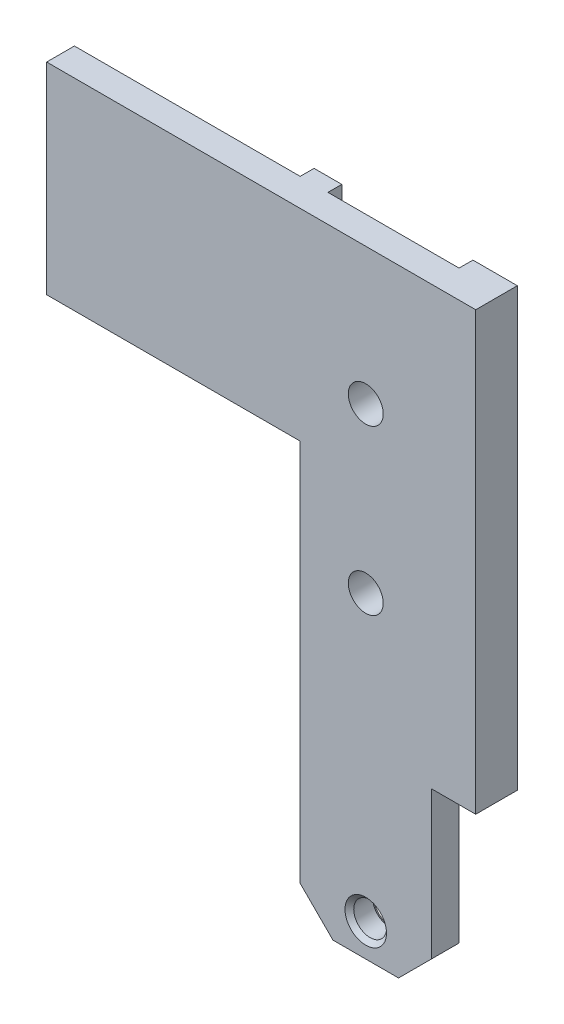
from build123d import *

# Parameters (mm, degrees)
EXTRUDE1_DEPTH        = 0.635
EXTRUDE1_DEPTH_BACK   = 0.635
SKETCH3_W             = 1.27
SKETCH3_H             = 9.225306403
SKETCH3_W_2           = 2.032
SKETCH3_H_2           = 28.255
EXTRUDE2_DEPTH        = 0.635
SKETCH4_R             = 0.75
CUT_EXTRUDE2_DEPTH    = 32.863459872
CHAMFER1_SIZE         = 0.2
SKETCH5_W             = 2.032
SKETCH5_H             = 8.255
CUT_EXTRUDE3_DEPTH    = 32.863459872
CHAMFER2_SIZE         = 1.5
M2X0_4_TAPPED_HOLE1_D = 1.6


with BuildPart() as part:
    # Sketch2 → Extrude1 (new, two sides: drawn at the far end of the back side and taken through both)
    with BuildSketch(Plane.XY.offset(-EXTRUDE1_DEPTH_BACK)):
        Polygon((5.03301, 0), (-14.605, 0), (-14.605, -9.225306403), (-3.00101, -9.225306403), (-3.00101, -28.255), (5.03301, -28.255), align=None)
    extrude(amount=EXTRUDE1_DEPTH + EXTRUDE1_DEPTH_BACK)

    # Sketch3 → Extrude2 (add)
    with BuildSketch(Plane(origin=(0, 0, -0.635), x_dir=(-1, 0, 0), z_dir=(0, 0, -1))):
        with Locations((3.63601, -4.612653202)):
            Rectangle(SKETCH3_W, SKETCH3_H)
        with Locations((-4.01701, -14.1275)):
            Rectangle(SKETCH3_W_2, SKETCH3_H_2)
    extrude(amount=EXTRUDE2_DEPTH)

    # Sketch4 → Cut-Extrude2 (cut, through all)
    with BuildSketch(Plane.XY.offset(0.635)):
        with Locations((0, -26.755)):
            Circle(SKETCH4_R)
    extrude(amount=-CUT_EXTRUDE2_DEPTH, mode=Mode.SUBTRACT)

    # Chamfer1
    chamfer1_edges = [part.edges().sort_by_distance(p)[0] for p in [
        (-0.75, -26.755, -0.635),
        (-0.75, -26.755, 0.635),
    ]]
    chamfer(chamfer1_edges, length=CHAMFER1_SIZE)

    # Sketch5 → Cut-Extrude3 (cut, through all)
    with BuildSketch(Plane.XY.offset(0.635)):
        with Locations((4.01701, -24.1275)):
            Rectangle(SKETCH5_W, SKETCH5_H)
    extrude(amount=-CUT_EXTRUDE3_DEPTH, mode=Mode.SUBTRACT)

    # Chamfer2
    chamfer2_edges = [part.edges().sort_by_distance(p)[0] for p in [
        (-3.00101, -28.255, 0),
        (3.00101, -28.255, 0),
    ]]
    chamfer(chamfer2_edges, length=CHAMFER2_SIZE)

    # M2x0.4 Tapped Hole1 (through all)
    with Locations(Plane.XY.offset(0.635)):
        with Locations((0, -13.75), (0, -6.25)):
            Hole(M2X0_4_TAPPED_HOLE1_D / 2)


solid = part.part
